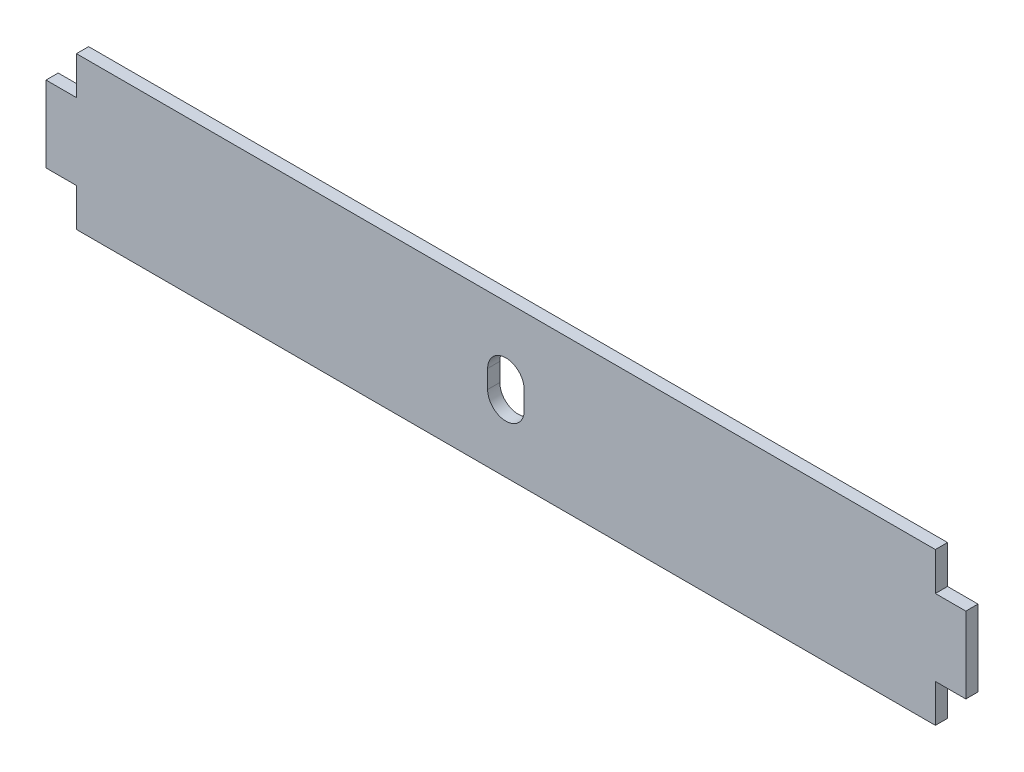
ISO-10303-21;
HEADER;
FILE_DESCRIPTION(('STEP AP214'),'2;1');
FILE_NAME('part.step','',(''),(''),'','','');
FILE_SCHEMA(('AUTOMOTIVE_DESIGN { 1 0 10303 214 1 1 1 1 }'));
ENDSEC;
DATA;
#1=APPLICATION_CONTEXT('core data for automotive mechanical design processes');
#2=APPLICATION_PROTOCOL_DEFINITION('international standard','automotive_design',2000,#1);
#3=PRODUCT_CONTEXT('',#1,'mechanical');
#4=PRODUCT('Part','Part','',(#3));
#5=PRODUCT_RELATED_PRODUCT_CATEGORY('part','',(#4));
#6=PRODUCT_DEFINITION_FORMATION('','',#4);
#7=PRODUCT_DEFINITION_CONTEXT('part definition',#1,'design');
#8=PRODUCT_DEFINITION('design','',#6,#7);
#9=PRODUCT_DEFINITION_SHAPE('','',#8);
#10=(LENGTH_UNIT() NAMED_UNIT(*) SI_UNIT(.MILLI.,.METRE.));
#11=(NAMED_UNIT(*) PLANE_ANGLE_UNIT() SI_UNIT($,.RADIAN.));
#12=(NAMED_UNIT(*) SI_UNIT($,.STERADIAN.) SOLID_ANGLE_UNIT());
#13=UNCERTAINTY_MEASURE_WITH_UNIT(LENGTH_MEASURE(1.E-05),#10,'distance_accuracy_value','');
#14=(GEOMETRIC_REPRESENTATION_CONTEXT(3) GLOBAL_UNCERTAINTY_ASSIGNED_CONTEXT((#13)) GLOBAL_UNIT_ASSIGNED_CONTEXT((#10,
#11,#12)) REPRESENTATION_CONTEXT('',''));
#15=CARTESIAN_POINT('',(0.,0.,0.));
#16=DIRECTION('',(0.,0.,1.));
#17=DIRECTION('',(1.,0.,0.));
#18=AXIS2_PLACEMENT_3D('',#15,#16,#17);
#19=CARTESIAN_POINT('',(0.,3.,4.));
#20=DIRECTION('',(0.,0.,-1.));
#21=DIRECTION('',(-1.,0.,0.));
#22=AXIS2_PLACEMENT_3D('',#19,#20,#21);
#23=CYLINDRICAL_SURFACE('',#22,6.);
#24=CARTESIAN_POINT('',(0.,3.,0.));
#25=DIRECTION('',(0.,0.,-1.));
#26=DIRECTION('',(1.,0.,0.));
#27=AXIS2_PLACEMENT_3D('',#24,#25,#26);
#28=CIRCLE('',#27,6.);
#29=CARTESIAN_POINT('',(-6.,3.,0.));
#30=VERTEX_POINT('',#29);
#31=CARTESIAN_POINT('',(6.,3.,0.));
#32=VERTEX_POINT('',#31);
#33=EDGE_CURVE('E137',#30,#32,#28,.T.);
#34=ORIENTED_EDGE('',*,*,#33,.T.);
#35=DIRECTION('',(0.,0.,-1.));
#36=VECTOR('',#35,1.);
#37=CARTESIAN_POINT('',(6.,3.,4.));
#38=LINE('',#37,#36);
#39=CARTESIAN_POINT('',(6.,3.,4.));
#40=VERTEX_POINT('',#39);
#41=EDGE_CURVE('E11',#40,#32,#38,.T.);
#42=ORIENTED_EDGE('',*,*,#41,.F.);
#43=CARTESIAN_POINT('',(0.,3.,4.));
#44=DIRECTION('',(0.,0.,-1.));
#45=DIRECTION('',(1.,0.,0.));
#46=AXIS2_PLACEMENT_3D('',#43,#44,#45);
#47=CIRCLE('',#46,6.);
#48=CARTESIAN_POINT('',(-6.,3.,4.));
#49=VERTEX_POINT('',#48);
#50=EDGE_CURVE('E94',#49,#40,#47,.T.);
#51=ORIENTED_EDGE('',*,*,#50,.F.);
#52=DIRECTION('',(0.,0.,-1.));
#53=VECTOR('',#52,1.);
#54=CARTESIAN_POINT('',(-6.,3.,4.));
#55=LINE('',#54,#53);
#56=EDGE_CURVE('E201',#49,#30,#55,.T.);
#57=ORIENTED_EDGE('',*,*,#56,.T.);
#58=EDGE_LOOP('',(#34,#42,#51,#57));
#59=FACE_BOUND('',#58,.T.);
#60=ADVANCED_FACE('F33',(#59),#23,.F.);
#61=CARTESIAN_POINT('',(6.,-3.,4.));
#62=DIRECTION('',(1.,0.,0.));
#63=DIRECTION('',(0.,0.,-1.));
#64=AXIS2_PLACEMENT_3D('',#61,#62,#63);
#65=PLANE('',#64);
#66=DIRECTION('',(0.,-1.,0.));
#67=VECTOR('',#66,1.);
#68=CARTESIAN_POINT('',(6.,-3.,0.));
#69=LINE('',#68,#67);
#70=CARTESIAN_POINT('',(6.,-3.,0.));
#71=VERTEX_POINT('',#70);
#72=EDGE_CURVE('E139',#32,#71,#69,.T.);
#73=ORIENTED_EDGE('',*,*,#72,.T.);
#74=DIRECTION('',(0.,0.,-1.));
#75=VECTOR('',#74,1.);
#76=CARTESIAN_POINT('',(6.,-3.,4.));
#77=LINE('',#76,#75);
#78=CARTESIAN_POINT('',(6.,-3.,4.));
#79=VERTEX_POINT('',#78);
#80=EDGE_CURVE('E41',#79,#71,#77,.T.);
#81=ORIENTED_EDGE('',*,*,#80,.F.);
#82=DIRECTION('',(0.,-1.,0.));
#83=VECTOR('',#82,1.);
#84=CARTESIAN_POINT('',(6.,-3.,4.));
#85=LINE('',#84,#83);
#86=EDGE_CURVE('E224',#40,#79,#85,.T.);
#87=ORIENTED_EDGE('',*,*,#86,.F.);
#88=ORIENTED_EDGE('',*,*,#41,.T.);
#89=EDGE_LOOP('',(#73,#81,#87,#88));
#90=FACE_BOUND('',#89,.T.);
#91=ADVANCED_FACE('F329',(#90),#65,.F.);
#92=CARTESIAN_POINT('',(0.,-3.,4.));
#93=DIRECTION('',(0.,0.,-1.));
#94=DIRECTION('',(-1.,0.,0.));
#95=AXIS2_PLACEMENT_3D('',#92,#93,#94);
#96=CYLINDRICAL_SURFACE('',#95,6.);
#97=CARTESIAN_POINT('',(0.,-3.,0.));
#98=DIRECTION('',(0.,0.,-1.));
#99=DIRECTION('',(1.,0.,0.));
#100=AXIS2_PLACEMENT_3D('',#97,#98,#99);
#101=CIRCLE('',#100,6.);
#102=CARTESIAN_POINT('',(-6.,-3.,0.));
#103=VERTEX_POINT('',#102);
#104=EDGE_CURVE('E142',#71,#103,#101,.T.);
#105=ORIENTED_EDGE('',*,*,#104,.T.);
#106=DIRECTION('',(0.,0.,-1.));
#107=VECTOR('',#106,1.);
#108=CARTESIAN_POINT('',(-6.,-3.,4.));
#109=LINE('',#108,#107);
#110=CARTESIAN_POINT('',(-6.,-3.,4.));
#111=VERTEX_POINT('',#110);
#112=EDGE_CURVE('E203',#111,#103,#109,.T.);
#113=ORIENTED_EDGE('',*,*,#112,.F.);
#114=CARTESIAN_POINT('',(0.,-3.,4.));
#115=DIRECTION('',(0.,0.,-1.));
#116=DIRECTION('',(1.,0.,0.));
#117=AXIS2_PLACEMENT_3D('',#114,#115,#116);
#118=CIRCLE('',#117,6.);
#119=EDGE_CURVE('E175',#79,#111,#118,.T.);
#120=ORIENTED_EDGE('',*,*,#119,.F.);
#121=ORIENTED_EDGE('',*,*,#80,.T.);
#122=EDGE_LOOP('',(#105,#113,#120,#121));
#123=FACE_BOUND('',#122,.T.);
#124=ADVANCED_FACE('F170',(#123),#96,.F.);
#125=CARTESIAN_POINT('',(0.,-25.,4.));
#126=DIRECTION('',(0.,1.,0.));
#127=DIRECTION('',(0.,0.,1.));
#128=AXIS2_PLACEMENT_3D('',#125,#126,#127);
#129=PLANE('',#128);
#130=DIRECTION('',(1.,0.,0.));
#131=VECTOR('',#130,1.);
#132=CARTESIAN_POINT('',(0.,-25.,0.));
#133=LINE('',#132,#131);
#134=CARTESIAN_POINT('',(-141.,-25.,0.));
#135=VERTEX_POINT('',#134);
#136=CARTESIAN_POINT('',(141.,-25.,0.));
#137=VERTEX_POINT('',#136);
#138=EDGE_CURVE('E145',#135,#137,#133,.T.);
#139=ORIENTED_EDGE('',*,*,#138,.T.);
#140=DIRECTION('',(0.,0.,-1.));
#141=VECTOR('',#140,1.);
#142=CARTESIAN_POINT('',(141.,-25.,4.));
#143=LINE('',#142,#141);
#144=CARTESIAN_POINT('',(141.,-25.,4.));
#145=VERTEX_POINT('',#144);
#146=EDGE_CURVE('E163',#145,#137,#143,.T.);
#147=ORIENTED_EDGE('',*,*,#146,.F.);
#148=DIRECTION('',(1.,0.,0.));
#149=VECTOR('',#148,1.);
#150=CARTESIAN_POINT('',(0.,-25.,4.));
#151=LINE('',#150,#149);
#152=CARTESIAN_POINT('',(-141.,-25.,4.));
#153=VERTEX_POINT('',#152);
#154=EDGE_CURVE('E227',#153,#145,#151,.T.);
#155=ORIENTED_EDGE('',*,*,#154,.F.);
#156=DIRECTION('',(0.,0.,-1.));
#157=VECTOR('',#156,1.);
#158=CARTESIAN_POINT('',(-141.,-25.,4.));
#159=LINE('',#158,#157);
#160=EDGE_CURVE('E206',#153,#135,#159,.T.);
#161=ORIENTED_EDGE('',*,*,#160,.T.);
#162=EDGE_LOOP('',(#139,#147,#155,#161));
#163=FACE_BOUND('',#162,.T.);
#164=ADVANCED_FACE('F321',(#163),#129,.F.);
#165=CARTESIAN_POINT('',(141.,-12.5,4.));
#166=DIRECTION('',(-1.,0.,0.));
#167=DIRECTION('',(0.,0.,1.));
#168=AXIS2_PLACEMENT_3D('',#165,#166,#167);
#169=PLANE('',#168);
#170=DIRECTION('',(0.,1.,0.));
#171=VECTOR('',#170,1.);
#172=CARTESIAN_POINT('',(141.,-12.5,0.));
#173=LINE('',#172,#171);
#174=CARTESIAN_POINT('',(141.,-12.5,0.));
#175=VERTEX_POINT('',#174);
#176=EDGE_CURVE('E147',#137,#175,#173,.T.);
#177=ORIENTED_EDGE('',*,*,#176,.T.);
#178=DIRECTION('',(0.,0.,-1.));
#179=VECTOR('',#178,1.);
#180=CARTESIAN_POINT('',(141.,-12.5,4.));
#181=LINE('',#180,#179);
#182=CARTESIAN_POINT('',(141.,-12.5,4.));
#183=VERTEX_POINT('',#182);
#184=EDGE_CURVE('E160',#183,#175,#181,.T.);
#185=ORIENTED_EDGE('',*,*,#184,.F.);
#186=DIRECTION('',(0.,1.,0.));
#187=VECTOR('',#186,1.);
#188=CARTESIAN_POINT('',(141.,-12.5,4.));
#189=LINE('',#188,#187);
#190=EDGE_CURVE('E229',#145,#183,#189,.T.);
#191=ORIENTED_EDGE('',*,*,#190,.F.);
#192=ORIENTED_EDGE('',*,*,#146,.T.);
#193=EDGE_LOOP('',(#177,#185,#191,#192));
#194=FACE_BOUND('',#193,.T.);
#195=ADVANCED_FACE('F236',(#194),#169,.F.);
#196=CARTESIAN_POINT('',(141.,-12.5,4.));
#197=DIRECTION('',(0.,1.,0.));
#198=DIRECTION('',(0.,0.,1.));
#199=AXIS2_PLACEMENT_3D('',#196,#197,#198);
#200=PLANE('',#199);
#201=DIRECTION('',(1.,0.,0.));
#202=VECTOR('',#201,1.);
#203=CARTESIAN_POINT('',(141.,-12.5,0.));
#204=LINE('',#203,#202);
#205=CARTESIAN_POINT('',(151.,-12.5,0.));
#206=VERTEX_POINT('',#205);
#207=EDGE_CURVE('E149',#175,#206,#204,.T.);
#208=ORIENTED_EDGE('',*,*,#207,.T.);
#209=DIRECTION('',(0.,0.,-1.));
#210=VECTOR('',#209,1.);
#211=CARTESIAN_POINT('',(151.,-12.5,4.));
#212=LINE('',#211,#210);
#213=CARTESIAN_POINT('',(151.,-12.5,4.));
#214=VERTEX_POINT('',#213);
#215=EDGE_CURVE('E126',#214,#206,#212,.T.);
#216=ORIENTED_EDGE('',*,*,#215,.F.);
#217=DIRECTION('',(1.,0.,0.));
#218=VECTOR('',#217,1.);
#219=CARTESIAN_POINT('',(141.,-12.5,4.));
#220=LINE('',#219,#218);
#221=EDGE_CURVE('E117',#183,#214,#220,.T.);
#222=ORIENTED_EDGE('',*,*,#221,.F.);
#223=ORIENTED_EDGE('',*,*,#184,.T.);
#224=EDGE_LOOP('',(#208,#216,#222,#223));
#225=FACE_BOUND('',#224,.T.);
#226=ADVANCED_FACE('F240',(#225),#200,.F.);
#227=CARTESIAN_POINT('',(151.,12.5,4.));
#228=DIRECTION('',(-1.,0.,0.));
#229=DIRECTION('',(0.,-1.,0.));
#230=AXIS2_PLACEMENT_3D('',#227,#228,#229);
#231=PLANE('',#230);
#232=DIRECTION('',(0.,1.,0.));
#233=VECTOR('',#232,1.);
#234=CARTESIAN_POINT('',(151.,12.5,0.));
#235=LINE('',#234,#233);
#236=CARTESIAN_POINT('',(151.,12.5,0.));
#237=VERTEX_POINT('',#236);
#238=EDGE_CURVE('E125',#206,#237,#235,.T.);
#239=ORIENTED_EDGE('',*,*,#238,.T.);
#240=DIRECTION('',(0.,0.,-1.));
#241=VECTOR('',#240,1.);
#242=CARTESIAN_POINT('',(151.,12.5,4.));
#243=LINE('',#242,#241);
#244=CARTESIAN_POINT('',(151.,12.5,4.));
#245=VERTEX_POINT('',#244);
#246=EDGE_CURVE('E122',#245,#237,#243,.T.);
#247=ORIENTED_EDGE('',*,*,#246,.F.);
#248=DIRECTION('',(0.,1.,0.));
#249=VECTOR('',#248,1.);
#250=CARTESIAN_POINT('',(151.,12.5,4.));
#251=LINE('',#250,#249);
#252=EDGE_CURVE('E111',#214,#245,#251,.T.);
#253=ORIENTED_EDGE('',*,*,#252,.F.);
#254=ORIENTED_EDGE('',*,*,#215,.T.);
#255=EDGE_LOOP('',(#239,#247,#253,#254));
#256=FACE_BOUND('',#255,.T.);
#257=ADVANCED_FACE('F123',(#256),#231,.F.);
#258=CARTESIAN_POINT('',(141.,12.5,4.));
#259=DIRECTION('',(0.,-1.,0.));
#260=DIRECTION('',(0.,0.,-1.));
#261=AXIS2_PLACEMENT_3D('',#258,#259,#260);
#262=PLANE('',#261);
#263=DIRECTION('',(-1.,0.,0.));
#264=VECTOR('',#263,1.);
#265=CARTESIAN_POINT('',(141.,12.5,0.));
#266=LINE('',#265,#264);
#267=CARTESIAN_POINT('',(141.,12.5,0.));
#268=VERTEX_POINT('',#267);
#269=EDGE_CURVE('E79',#237,#268,#266,.T.);
#270=ORIENTED_EDGE('',*,*,#269,.T.);
#271=DIRECTION('',(0.,0.,-1.));
#272=VECTOR('',#271,1.);
#273=CARTESIAN_POINT('',(141.,12.5,4.));
#274=LINE('',#273,#272);
#275=CARTESIAN_POINT('',(141.,12.5,4.));
#276=VERTEX_POINT('',#275);
#277=EDGE_CURVE('E127',#276,#268,#274,.T.);
#278=ORIENTED_EDGE('',*,*,#277,.F.);
#279=DIRECTION('',(-1.,0.,0.));
#280=VECTOR('',#279,1.);
#281=CARTESIAN_POINT('',(141.,12.5,4.));
#282=LINE('',#281,#280);
#283=EDGE_CURVE('E115',#245,#276,#282,.T.);
#284=ORIENTED_EDGE('',*,*,#283,.F.);
#285=ORIENTED_EDGE('',*,*,#246,.T.);
#286=EDGE_LOOP('',(#270,#278,#284,#285));
#287=FACE_BOUND('',#286,.T.);
#288=ADVANCED_FACE('F129',(#287),#262,.F.);
#289=CARTESIAN_POINT('',(141.,25.,4.));
#290=DIRECTION('',(-1.,0.,0.));
#291=DIRECTION('',(0.,0.,1.));
#292=AXIS2_PLACEMENT_3D('',#289,#290,#291);
#293=PLANE('',#292);
#294=DIRECTION('',(0.,1.,0.));
#295=VECTOR('',#294,1.);
#296=CARTESIAN_POINT('',(141.,25.,0.));
#297=LINE('',#296,#295);
#298=CARTESIAN_POINT('',(141.,25.,0.));
#299=VERTEX_POINT('',#298);
#300=EDGE_CURVE('E85',#268,#299,#297,.T.);
#301=ORIENTED_EDGE('',*,*,#300,.T.);
#302=DIRECTION('',(0.,0.,-1.));
#303=VECTOR('',#302,1.);
#304=CARTESIAN_POINT('',(141.,25.,4.));
#305=LINE('',#304,#303);
#306=CARTESIAN_POINT('',(141.,25.,4.));
#307=VERTEX_POINT('',#306);
#308=EDGE_CURVE('E136',#307,#299,#305,.T.);
#309=ORIENTED_EDGE('',*,*,#308,.F.);
#310=DIRECTION('',(0.,1.,0.));
#311=VECTOR('',#310,1.);
#312=CARTESIAN_POINT('',(141.,25.,4.));
#313=LINE('',#312,#311);
#314=EDGE_CURVE('E49',#276,#307,#313,.T.);
#315=ORIENTED_EDGE('',*,*,#314,.F.);
#316=ORIENTED_EDGE('',*,*,#277,.T.);
#317=EDGE_LOOP('',(#301,#309,#315,#316));
#318=FACE_BOUND('',#317,.T.);
#319=ADVANCED_FACE('F358',(#318),#293,.F.);
#320=CARTESIAN_POINT('',(0.,25.,4.));
#321=DIRECTION('',(0.,-1.,0.));
#322=DIRECTION('',(0.,0.,-1.));
#323=AXIS2_PLACEMENT_3D('',#320,#321,#322);
#324=PLANE('',#323);
#325=DIRECTION('',(-1.,0.,0.));
#326=VECTOR('',#325,1.);
#327=CARTESIAN_POINT('',(0.,25.,0.));
#328=LINE('',#327,#326);
#329=CARTESIAN_POINT('',(-141.,25.,0.));
#330=VERTEX_POINT('',#329);
#331=EDGE_CURVE('E154',#299,#330,#328,.T.);
#332=ORIENTED_EDGE('',*,*,#331,.T.);
#333=DIRECTION('',(0.,0.,-1.));
#334=VECTOR('',#333,1.);
#335=CARTESIAN_POINT('',(-141.,25.,4.));
#336=LINE('',#335,#334);
#337=CARTESIAN_POINT('',(-141.,25.,4.));
#338=VERTEX_POINT('',#337);
#339=EDGE_CURVE('E140',#338,#330,#336,.T.);
#340=ORIENTED_EDGE('',*,*,#339,.F.);
#341=DIRECTION('',(-1.,0.,0.));
#342=VECTOR('',#341,1.);
#343=CARTESIAN_POINT('',(0.,25.,4.));
#344=LINE('',#343,#342);
#345=EDGE_CURVE('E131',#307,#338,#344,.T.);
#346=ORIENTED_EDGE('',*,*,#345,.F.);
#347=ORIENTED_EDGE('',*,*,#308,.T.);
#348=EDGE_LOOP('',(#332,#340,#346,#347));
#349=FACE_BOUND('',#348,.T.);
#350=ADVANCED_FACE('F249',(#349),#324,.F.);
#351=CARTESIAN_POINT('',(0.,3.,4.));
#352=DIRECTION('',(0.,0.,1.));
#353=DIRECTION('',(1.,0.,0.));
#354=AXIS2_PLACEMENT_3D('',#351,#352,#353);
#355=PLANE('',#354);
#356=DIRECTION('',(0.,-1.,0.));
#357=VECTOR('',#356,1.);
#358=CARTESIAN_POINT('',(-6.,-3.,4.));
#359=LINE('',#358,#357);
#360=EDGE_CURVE('E204',#49,#111,#359,.T.);
#361=ORIENTED_EDGE('',*,*,#360,.F.);
#362=ORIENTED_EDGE('',*,*,#50,.T.);
#363=ORIENTED_EDGE('',*,*,#86,.T.);
#364=ORIENTED_EDGE('',*,*,#119,.T.);
#365=EDGE_LOOP('',(#361,#362,#363,#364));
#366=FACE_BOUND('',#365,.T.);
#367=ORIENTED_EDGE('',*,*,#345,.T.);
#368=DIRECTION('',(0.,1.,0.));
#369=VECTOR('',#368,1.);
#370=CARTESIAN_POINT('',(-141.,25.,4.));
#371=LINE('',#370,#369);
#372=CARTESIAN_POINT('',(-141.,12.5,4.));
#373=VERTEX_POINT('',#372);
#374=EDGE_CURVE('E190',#373,#338,#371,.T.);
#375=ORIENTED_EDGE('',*,*,#374,.F.);
#376=DIRECTION('',(1.,0.,0.));
#377=VECTOR('',#376,1.);
#378=CARTESIAN_POINT('',(-141.,12.5,4.));
#379=LINE('',#378,#377);
#380=CARTESIAN_POINT('',(-151.,12.5,4.));
#381=VERTEX_POINT('',#380);
#382=EDGE_CURVE('E194',#381,#373,#379,.T.);
#383=ORIENTED_EDGE('',*,*,#382,.F.);
#384=DIRECTION('',(0.,1.,0.));
#385=VECTOR('',#384,1.);
#386=CARTESIAN_POINT('',(-151.,12.5,4.));
#387=LINE('',#386,#385);
#388=CARTESIAN_POINT('',(-151.,-12.5,4.));
#389=VERTEX_POINT('',#388);
#390=EDGE_CURVE('E270',#389,#381,#387,.T.);
#391=ORIENTED_EDGE('',*,*,#390,.F.);
#392=DIRECTION('',(-1.,0.,0.));
#393=VECTOR('',#392,1.);
#394=CARTESIAN_POINT('',(-141.,-12.5,4.));
#395=LINE('',#394,#393);
#396=CARTESIAN_POINT('',(-141.,-12.5,4.));
#397=VERTEX_POINT('',#396);
#398=EDGE_CURVE('E272',#397,#389,#395,.T.);
#399=ORIENTED_EDGE('',*,*,#398,.F.);
#400=DIRECTION('',(0.,1.,0.));
#401=VECTOR('',#400,1.);
#402=CARTESIAN_POINT('',(-141.,-12.5,4.));
#403=LINE('',#402,#401);
#404=EDGE_CURVE('E277',#153,#397,#403,.T.);
#405=ORIENTED_EDGE('',*,*,#404,.F.);
#406=ORIENTED_EDGE('',*,*,#154,.T.);
#407=ORIENTED_EDGE('',*,*,#190,.T.);
#408=ORIENTED_EDGE('',*,*,#221,.T.);
#409=ORIENTED_EDGE('',*,*,#252,.T.);
#410=ORIENTED_EDGE('',*,*,#283,.T.);
#411=ORIENTED_EDGE('',*,*,#314,.T.);
#412=EDGE_LOOP('',(#367,#375,#383,#391,#399,#405,#406,#407,#408,#409,#410,#411));
#413=FACE_BOUND('',#412,.T.);
#414=ADVANCED_FACE('F113',(#366,#413),#355,.T.);
#415=CARTESIAN_POINT('',(0.,3.,0.));
#416=DIRECTION('',(0.,0.,1.));
#417=DIRECTION('',(1.,0.,0.));
#418=AXIS2_PLACEMENT_3D('',#415,#416,#417);
#419=PLANE('',#418);
#420=ORIENTED_EDGE('',*,*,#33,.F.);
#421=DIRECTION('',(0.,-1.,0.));
#422=VECTOR('',#421,1.);
#423=CARTESIAN_POINT('',(-6.,-3.,0.));
#424=LINE('',#423,#422);
#425=EDGE_CURVE('E185',#30,#103,#424,.T.);
#426=ORIENTED_EDGE('',*,*,#425,.T.);
#427=ORIENTED_EDGE('',*,*,#104,.F.);
#428=ORIENTED_EDGE('',*,*,#72,.F.);
#429=EDGE_LOOP('',(#420,#426,#427,#428));
#430=FACE_BOUND('',#429,.T.);
#431=DIRECTION('',(0.,1.,0.));
#432=VECTOR('',#431,1.);
#433=CARTESIAN_POINT('',(-141.,25.,0.));
#434=LINE('',#433,#432);
#435=CARTESIAN_POINT('',(-141.,12.5,0.));
#436=VERTEX_POINT('',#435);
#437=EDGE_CURVE('E246',#436,#330,#434,.T.);
#438=ORIENTED_EDGE('',*,*,#437,.T.);
#439=ORIENTED_EDGE('',*,*,#331,.F.);
#440=ORIENTED_EDGE('',*,*,#300,.F.);
#441=ORIENTED_EDGE('',*,*,#269,.F.);
#442=ORIENTED_EDGE('',*,*,#238,.F.);
#443=ORIENTED_EDGE('',*,*,#207,.F.);
#444=ORIENTED_EDGE('',*,*,#176,.F.);
#445=ORIENTED_EDGE('',*,*,#138,.F.);
#446=DIRECTION('',(0.,1.,0.));
#447=VECTOR('',#446,1.);
#448=CARTESIAN_POINT('',(-141.,-12.5,0.));
#449=LINE('',#448,#447);
#450=CARTESIAN_POINT('',(-141.,-12.5,0.));
#451=VERTEX_POINT('',#450);
#452=EDGE_CURVE('E191',#135,#451,#449,.T.);
#453=ORIENTED_EDGE('',*,*,#452,.T.);
#454=DIRECTION('',(-1.,0.,0.));
#455=VECTOR('',#454,1.);
#456=CARTESIAN_POINT('',(-141.,-12.5,0.));
#457=LINE('',#456,#455);
#458=CARTESIAN_POINT('',(-151.,-12.5,0.));
#459=VERTEX_POINT('',#458);
#460=EDGE_CURVE('E197',#451,#459,#457,.T.);
#461=ORIENTED_EDGE('',*,*,#460,.T.);
#462=DIRECTION('',(0.,1.,0.));
#463=VECTOR('',#462,1.);
#464=CARTESIAN_POINT('',(-151.,12.5,0.));
#465=LINE('',#464,#463);
#466=CARTESIAN_POINT('',(-151.,12.5,0.));
#467=VERTEX_POINT('',#466);
#468=EDGE_CURVE('E285',#459,#467,#465,.T.);
#469=ORIENTED_EDGE('',*,*,#468,.T.);
#470=DIRECTION('',(1.,0.,0.));
#471=VECTOR('',#470,1.);
#472=CARTESIAN_POINT('',(-141.,12.5,0.));
#473=LINE('',#472,#471);
#474=EDGE_CURVE('E283',#467,#436,#473,.T.);
#475=ORIENTED_EDGE('',*,*,#474,.T.);
#476=EDGE_LOOP('',(#438,#439,#440,#441,#442,#443,#444,#445,#453,#461,#469,#475));
#477=FACE_BOUND('',#476,.T.);
#478=ADVANCED_FACE('F182',(#430,#477),#419,.F.);
#479=CARTESIAN_POINT('',(-141.,25.,4.));
#480=DIRECTION('',(-1.,0.,0.));
#481=DIRECTION('',(0.,0.,1.));
#482=AXIS2_PLACEMENT_3D('',#479,#480,#481);
#483=PLANE('',#482);
#484=ORIENTED_EDGE('',*,*,#437,.F.);
#485=DIRECTION('',(0.,0.,-1.));
#486=VECTOR('',#485,1.);
#487=CARTESIAN_POINT('',(-141.,12.5,4.));
#488=LINE('',#487,#486);
#489=EDGE_CURVE('E218',#373,#436,#488,.T.);
#490=ORIENTED_EDGE('',*,*,#489,.F.);
#491=ORIENTED_EDGE('',*,*,#374,.T.);
#492=ORIENTED_EDGE('',*,*,#339,.T.);
#493=EDGE_LOOP('',(#484,#490,#491,#492));
#494=FACE_BOUND('',#493,.T.);
#495=ADVANCED_FACE('F255',(#494),#483,.T.);
#496=CARTESIAN_POINT('',(-141.,12.5,4.));
#497=DIRECTION('',(0.,1.,0.));
#498=DIRECTION('',(0.,0.,1.));
#499=AXIS2_PLACEMENT_3D('',#496,#497,#498);
#500=PLANE('',#499);
#501=ORIENTED_EDGE('',*,*,#474,.F.);
#502=DIRECTION('',(0.,0.,-1.));
#503=VECTOR('',#502,1.);
#504=CARTESIAN_POINT('',(-151.,12.5,4.));
#505=LINE('',#504,#503);
#506=EDGE_CURVE('E215',#381,#467,#505,.T.);
#507=ORIENTED_EDGE('',*,*,#506,.F.);
#508=ORIENTED_EDGE('',*,*,#382,.T.);
#509=ORIENTED_EDGE('',*,*,#489,.T.);
#510=EDGE_LOOP('',(#501,#507,#508,#509));
#511=FACE_BOUND('',#510,.T.);
#512=ADVANCED_FACE('F269',(#511),#500,.T.);
#513=CARTESIAN_POINT('',(-151.,12.5,4.));
#514=DIRECTION('',(-1.,0.,0.));
#515=DIRECTION('',(0.,-1.,0.));
#516=AXIS2_PLACEMENT_3D('',#513,#514,#515);
#517=PLANE('',#516);
#518=ORIENTED_EDGE('',*,*,#468,.F.);
#519=DIRECTION('',(0.,0.,-1.));
#520=VECTOR('',#519,1.);
#521=CARTESIAN_POINT('',(-151.,-12.5,4.));
#522=LINE('',#521,#520);
#523=EDGE_CURVE('E212',#389,#459,#522,.T.);
#524=ORIENTED_EDGE('',*,*,#523,.F.);
#525=ORIENTED_EDGE('',*,*,#390,.T.);
#526=ORIENTED_EDGE('',*,*,#506,.T.);
#527=EDGE_LOOP('',(#518,#524,#525,#526));
#528=FACE_BOUND('',#527,.T.);
#529=ADVANCED_FACE('F317',(#528),#517,.T.);
#530=CARTESIAN_POINT('',(-141.,-12.5,4.));
#531=DIRECTION('',(0.,-1.,0.));
#532=DIRECTION('',(0.,0.,-1.));
#533=AXIS2_PLACEMENT_3D('',#530,#531,#532);
#534=PLANE('',#533);
#535=ORIENTED_EDGE('',*,*,#460,.F.);
#536=DIRECTION('',(0.,0.,-1.));
#537=VECTOR('',#536,1.);
#538=CARTESIAN_POINT('',(-141.,-12.5,4.));
#539=LINE('',#538,#537);
#540=EDGE_CURVE('E209',#397,#451,#539,.T.);
#541=ORIENTED_EDGE('',*,*,#540,.F.);
#542=ORIENTED_EDGE('',*,*,#398,.T.);
#543=ORIENTED_EDGE('',*,*,#523,.T.);
#544=EDGE_LOOP('',(#535,#541,#542,#543));
#545=FACE_BOUND('',#544,.T.);
#546=ADVANCED_FACE('F298',(#545),#534,.T.);
#547=CARTESIAN_POINT('',(-141.,-12.5,4.));
#548=DIRECTION('',(-1.,0.,0.));
#549=DIRECTION('',(0.,0.,1.));
#550=AXIS2_PLACEMENT_3D('',#547,#548,#549);
#551=PLANE('',#550);
#552=ORIENTED_EDGE('',*,*,#452,.F.);
#553=ORIENTED_EDGE('',*,*,#160,.F.);
#554=ORIENTED_EDGE('',*,*,#404,.T.);
#555=ORIENTED_EDGE('',*,*,#540,.T.);
#556=EDGE_LOOP('',(#552,#553,#554,#555));
#557=FACE_BOUND('',#556,.T.);
#558=ADVANCED_FACE('F319',(#557),#551,.T.);
#559=CARTESIAN_POINT('',(-6.,-3.,4.));
#560=DIRECTION('',(1.,0.,0.));
#561=DIRECTION('',(0.,0.,-1.));
#562=AXIS2_PLACEMENT_3D('',#559,#560,#561);
#563=PLANE('',#562);
#564=ORIENTED_EDGE('',*,*,#425,.F.);
#565=ORIENTED_EDGE('',*,*,#56,.F.);
#566=ORIENTED_EDGE('',*,*,#360,.T.);
#567=ORIENTED_EDGE('',*,*,#112,.T.);
#568=EDGE_LOOP('',(#564,#565,#566,#567));
#569=FACE_BOUND('',#568,.T.);
#570=ADVANCED_FACE('F336',(#569),#563,.T.);
#571=CLOSED_SHELL('',(#60,#91,#124,#164,#195,#226,#257,#288,#319,#350,#414,#478,#495,#512,#529,
#546,#558,#570));
#572=MANIFOLD_SOLID_BREP('B2',#571);
#573=ADVANCED_BREP_SHAPE_REPRESENTATION('',(#18,#572),#14);
#574=SHAPE_DEFINITION_REPRESENTATION(#9,#573);
ENDSEC;
END-ISO-10303-21;
